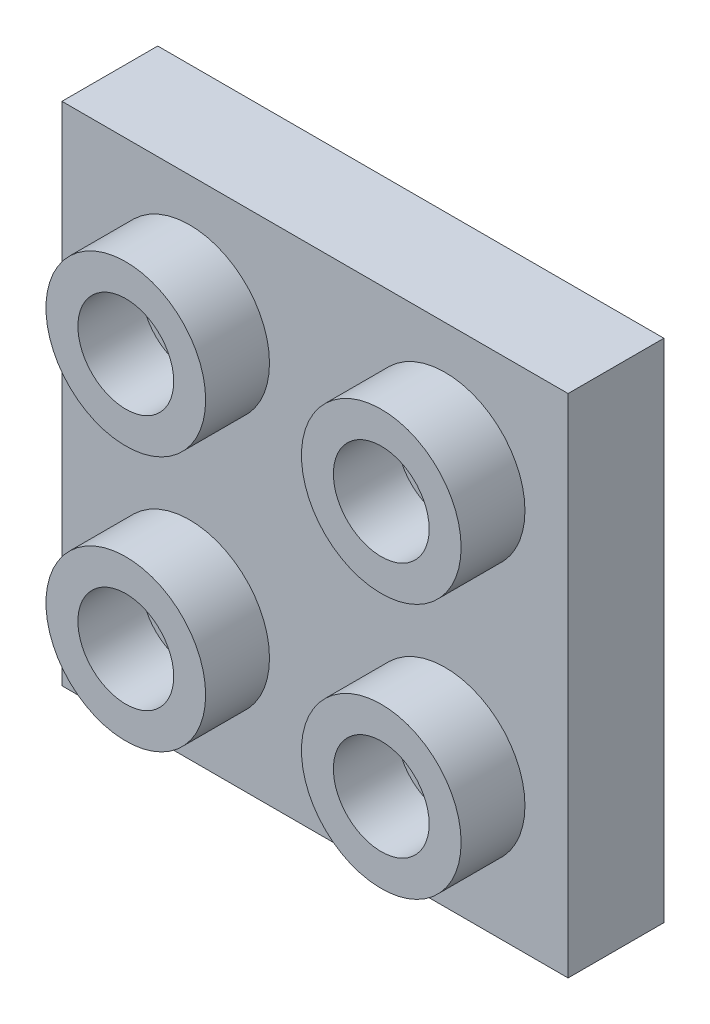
from build123d import *

# Parameters (mm, degrees)
SKETCH_1_W                  = 15.85
SKETCH_1_H                  = 15.85
EXTRUDE_750_DEPTH           = 3
SKETCH_2_R                  = 2.5
EXTRUDE_1_DEPTH             = 2
PATTERN_LINEAR_1_COUNT      = 2
PATTERN_LINEAR_1_PITCH      = 8
PATTERN_LINEAR_1_COUNT_DIR2 = 2
PATTERN_LINEAR_1_PITCH_DIR2 = 8
SKETCH_3_W                  = 12.85
SKETCH_3_H                  = 12.85
CUT_EXTRUDE_1_DEPTH         = 2
BOSS_EXTRUDE1_DEPTH         = 7
SKETCH_9_R                  = 1.5
CUT_EXTRUDE_6_DEPTH         = 2
PATTERN_LINEAR_2_COUNT      = 2
PATTERN_LINEAR_2_PITCH      = 8
PATTERN_LINEAR_2_COUNT_DIR2 = 2
PATTERN_LINEAR_2_PITCH_DIR2 = 8
SKETCH1_R                   = 3
CUT_EXTRUDE1_DEPTH          = 0.7
SKETCH2_R                   = 2.4
CUT_EXTRUDE3_DEPTH          = 8.7


with BuildPart() as part:
    # Sketch 1 → Extrude 750 (new body)
    with BuildSketch(Plane(origin=(0.007312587, -0.1312965, 0), x_dir=(1, 0, 0), z_dir=(0, 0, 1))):
        with Locations((-0.659916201, 0.074581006)):
            Rectangle(SKETCH_1_W, SKETCH_1_H)
    extrude(amount=-EXTRUDE_750_DEPTH)

    # Sketch 2 → Extrude 1 (add)
    with BuildSketch(Plane.XY):
        with Locations((-4.577603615, -3.981715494)):
            Circle(SKETCH_2_R)
    extrude_1 = extrude(amount=EXTRUDE_1_DEPTH)

    # Pattern Linear 1: Extrude 1 2 × 2
    with Locations(*[(i * PATTERN_LINEAR_1_PITCH, j * PATTERN_LINEAR_1_PITCH_DIR2, 0) for i in range(PATTERN_LINEAR_1_COUNT) for j in range(PATTERN_LINEAR_1_COUNT_DIR2) if (i, j) != (0, 0)]):
        add(extrude_1)

    # Sketch 3 → Cut-Extrude 1 (cut)
    with BuildSketch(Plane(origin=(0, 0, -3), x_dir=(-1, 0, 0), z_dir=(0, 0, -1))):
        with Locations((0.652603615, -0.056715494)):
            Rectangle(SKETCH_3_W, SKETCH_3_H)
    extrude(amount=-CUT_EXTRUDE_1_DEPTH, mode=Mode.SUBTRACT)

    # Sketch 4 → Boss-Extrude1 (add)
    with BuildSketch(Plane.XZ.offset(7.981715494)):
        with BuildLine():
            Line((3.422396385, -3.5), (3.422396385, 0))
            Line((3.422396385, 0), (-4.577603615, 0))
            Line((-4.577603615, 0), (-4.577603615, -3.5))
            ThreePointArc((-4.577603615, -3.5), (-0.577603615, -7.5), (3.422396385, -3.5))
        make_face()
    extrude(amount=-BOSS_EXTRUDE1_DEPTH)

    # Sketch 9 → Cut-Extrude 6 (cut)
    with BuildSketch(Plane.XY.offset(2)):
        with Locations((-4.577603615, -3.981715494)):
            Circle(SKETCH_9_R)
    cut_extrude_6 = extrude(amount=-CUT_EXTRUDE_6_DEPTH, mode=Mode.SUBTRACT)

    # Pattern Linear 2: Cut-Extrude 6 2 × 2
    with Locations(*[(j * PATTERN_LINEAR_2_PITCH_DIR2, i * PATTERN_LINEAR_2_PITCH, 0) for i in range(PATTERN_LINEAR_2_COUNT) for j in range(PATTERN_LINEAR_2_COUNT_DIR2) if (i, j) != (0, 0)]):
        add(cut_extrude_6, mode=Mode.SUBTRACT)

    # Sketch1 → Cut-Extrude1 (cut)
    with BuildSketch(Plane.XZ.offset(7.981715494)):
        with Locations(Location((-0.577603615, -3.5, 0), (0, 0, 270))):
            Circle(SKETCH1_R)
    extrude(amount=-CUT_EXTRUDE1_DEPTH, mode=Mode.SUBTRACT)

    # Sketch2 → Cut-Extrude3 (cut)
    with BuildSketch(Plane.XZ.offset(7.281715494)):
        with Locations(Location((-0.577603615, -3.5, 0), (0, 0, 270))):
            Circle(SKETCH2_R)
    extrude(amount=-CUT_EXTRUDE3_DEPTH, mode=Mode.SUBTRACT)


solid = part.part
